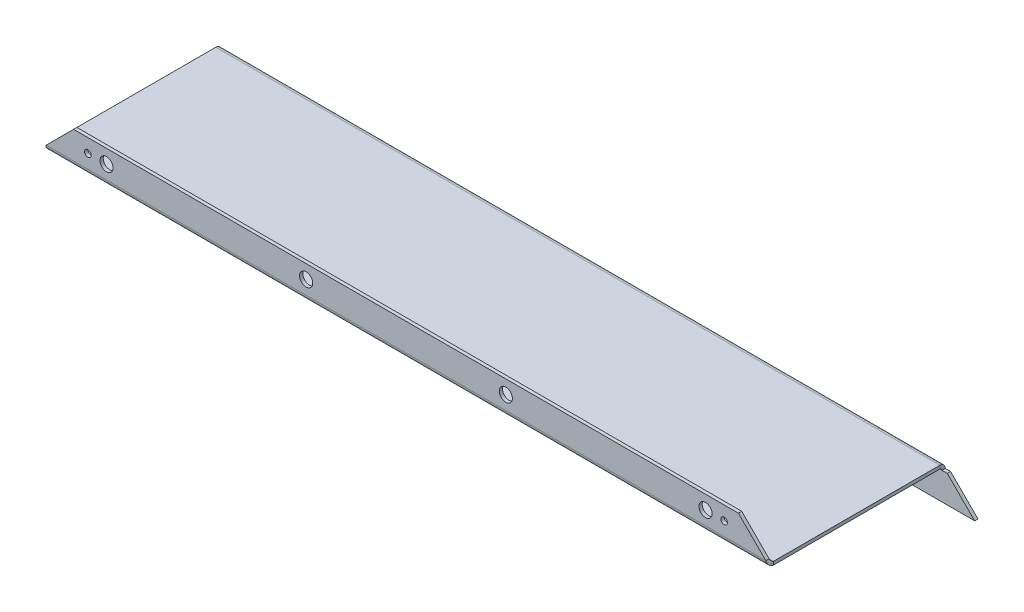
ISO-10303-21;
HEADER;
FILE_DESCRIPTION(('STEP AP214'),'2;1');
FILE_NAME('part.step','',(''),(''),'','','');
FILE_SCHEMA(('AUTOMOTIVE_DESIGN { 1 0 10303 214 1 1 1 1 }'));
ENDSEC;
DATA;
#1=APPLICATION_CONTEXT('core data for automotive mechanical design processes');
#2=APPLICATION_PROTOCOL_DEFINITION('international standard','automotive_design',2000,#1);
#3=PRODUCT_CONTEXT('',#1,'mechanical');
#4=PRODUCT('Part','Part','',(#3));
#5=PRODUCT_RELATED_PRODUCT_CATEGORY('part','',(#4));
#6=PRODUCT_DEFINITION_FORMATION('','',#4);
#7=PRODUCT_DEFINITION_CONTEXT('part definition',#1,'design');
#8=PRODUCT_DEFINITION('design','',#6,#7);
#9=PRODUCT_DEFINITION_SHAPE('','',#8);
#10=(LENGTH_UNIT() NAMED_UNIT(*) SI_UNIT(.MILLI.,.METRE.));
#11=(NAMED_UNIT(*) PLANE_ANGLE_UNIT() SI_UNIT($,.RADIAN.));
#12=(NAMED_UNIT(*) SI_UNIT($,.STERADIAN.) SOLID_ANGLE_UNIT());
#13=UNCERTAINTY_MEASURE_WITH_UNIT(LENGTH_MEASURE(1.E-05),#10,'distance_accuracy_value','');
#14=(GEOMETRIC_REPRESENTATION_CONTEXT(3) GLOBAL_UNCERTAINTY_ASSIGNED_CONTEXT((#13)) GLOBAL_UNIT_ASSIGNED_CONTEXT((#10,
#11,#12)) REPRESENTATION_CONTEXT('',''));
#15=CARTESIAN_POINT('',(0.,0.,0.));
#16=DIRECTION('',(0.,0.,1.));
#17=DIRECTION('',(1.,0.,0.));
#18=AXIS2_PLACEMENT_3D('',#15,#16,#17);
#19=CARTESIAN_POINT('',(165.,-710.5,-79.3));
#20=DIRECTION('',(1.,0.,0.));
#21=DIRECTION('',(0.,0.,-1.));
#22=AXIS2_PLACEMENT_3D('',#19,#20,#21);
#23=PLANE('',#22);
#24=DIRECTION('',(0.,0.,-1.));
#25=VECTOR('',#24,1.);
#26=CARTESIAN_POINT('',(165.,-710.5,-79.3));
#27=LINE('',#26,#25);
#28=CARTESIAN_POINT('',(165.,-710.5,-0.999999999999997));
#29=VERTEX_POINT('',#28);
#30=CARTESIAN_POINT('',(165.,-710.5,-76.8000000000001));
#31=VERTEX_POINT('',#30);
#32=EDGE_CURVE('E256',#29,#31,#27,.T.);
#33=ORIENTED_EDGE('',*,*,#32,.T.);
#34=DIRECTION('',(0.,1.,0.));
#35=VECTOR('',#34,1.);
#36=CARTESIAN_POINT('',(165.,-710.5,-76.8000000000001));
#37=LINE('',#36,#35);
#38=CARTESIAN_POINT('',(165.,-709.,-76.8000000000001));
#39=VERTEX_POINT('',#38);
#40=EDGE_CURVE('E231',#31,#39,#37,.T.);
#41=ORIENTED_EDGE('',*,*,#40,.T.);
#42=DIRECTION('',(0.,0.,1.));
#43=VECTOR('',#42,1.);
#44=CARTESIAN_POINT('',(165.,-709.,1.98944125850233E-12));
#45=LINE('',#44,#43);
#46=CARTESIAN_POINT('',(165.,-709.,-1.));
#47=VERTEX_POINT('',#46);
#48=EDGE_CURVE('E260',#47,#39,#45,.F.);
#49=ORIENTED_EDGE('',*,*,#48,.F.);
#50=DIRECTION('',(0.,-1.,0.));
#51=VECTOR('',#50,1.);
#52=CARTESIAN_POINT('',(165.,-710.5,-1.));
#53=LINE('',#52,#51);
#54=EDGE_CURVE('E251',#47,#29,#53,.T.);
#55=ORIENTED_EDGE('',*,*,#54,.T.);
#56=EDGE_LOOP('',(#33,#41,#49,#55));
#57=FACE_BOUND('',#56,.T.);
#58=ADVANCED_FACE('F78',(#57),#23,.T.);
#59=CARTESIAN_POINT('',(0.,-710.5,1.99467848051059E-12));
#60=DIRECTION('',(0.,-1.,0.));
#61=DIRECTION('',(0.,0.,-1.));
#62=AXIS2_PLACEMENT_3D('',#59,#60,#61);
#63=PLANE('',#62);
#64=DIRECTION('',(0.,0.,1.));
#65=VECTOR('',#64,1.);
#66=CARTESIAN_POINT('',(-165.000000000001,-710.5,0.));
#67=LINE('',#66,#65);
#68=CARTESIAN_POINT('',(-165.000000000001,-710.5,-76.8000000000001));
#69=VERTEX_POINT('',#68);
#70=CARTESIAN_POINT('',(-165.000000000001,-710.5,-0.999999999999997));
#71=VERTEX_POINT('',#70);
#72=EDGE_CURVE('E253',#69,#71,#67,.T.);
#73=ORIENTED_EDGE('',*,*,#72,.F.);
#74=DIRECTION('',(1.,0.,0.));
#75=VECTOR('',#74,1.);
#76=CARTESIAN_POINT('',(165.,-710.5,-76.8000000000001));
#77=LINE('',#76,#75);
#78=EDGE_CURVE('E102',#31,#69,#77,.F.);
#79=ORIENTED_EDGE('',*,*,#78,.F.);
#80=ORIENTED_EDGE('',*,*,#32,.F.);
#81=DIRECTION('',(-1.,0.,0.));
#82=VECTOR('',#81,1.);
#83=CARTESIAN_POINT('',(0.,-710.5,-0.999999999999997));
#84=LINE('',#83,#82);
#85=EDGE_CURVE('E263',#29,#71,#84,.T.);
#86=ORIENTED_EDGE('',*,*,#85,.T.);
#87=EDGE_LOOP('',(#73,#79,#80,#86));
#88=FACE_BOUND('',#87,.T.);
#89=ADVANCED_FACE('F368',(#88),#63,.T.);
#90=CARTESIAN_POINT('',(0.,-709.,1.98944125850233E-12));
#91=DIRECTION('',(0.,-1.,0.));
#92=DIRECTION('',(0.,0.,-1.));
#93=AXIS2_PLACEMENT_3D('',#90,#91,#92);
#94=PLANE('',#93);
#95=DIRECTION('',(1.,0.,0.));
#96=VECTOR('',#95,1.);
#97=CARTESIAN_POINT('',(165.,-709.,-76.8000000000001));
#98=LINE('',#97,#96);
#99=CARTESIAN_POINT('',(-165.000000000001,-709.,-76.8000000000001));
#100=VERTEX_POINT('',#99);
#101=EDGE_CURVE('E226',#39,#100,#98,.F.);
#102=ORIENTED_EDGE('',*,*,#101,.T.);
#103=DIRECTION('',(0.,0.,-1.));
#104=VECTOR('',#103,1.);
#105=CARTESIAN_POINT('',(-165.000000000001,-709.,1.98944125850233E-12));
#106=LINE('',#105,#104);
#107=CARTESIAN_POINT('',(-165.000000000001,-709.,-1.));
#108=VERTEX_POINT('',#107);
#109=EDGE_CURVE('E258',#100,#108,#106,.F.);
#110=ORIENTED_EDGE('',*,*,#109,.T.);
#111=DIRECTION('',(1.,0.,0.));
#112=VECTOR('',#111,1.);
#113=CARTESIAN_POINT('',(165.,-709.,-1.));
#114=LINE('',#113,#112);
#115=EDGE_CURVE('E269',#47,#108,#114,.F.);
#116=ORIENTED_EDGE('',*,*,#115,.F.);
#117=ORIENTED_EDGE('',*,*,#48,.T.);
#118=EDGE_LOOP('',(#102,#110,#116,#117));
#119=FACE_BOUND('',#118,.T.);
#120=ADVANCED_FACE('F354',(#119),#94,.F.);
#121=CARTESIAN_POINT('',(-166.5,-710.5,1.5));
#122=DIRECTION('',(0.707106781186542,-0.707106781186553,0.));
#123=DIRECTION('',(0.707106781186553,0.707106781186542,0.));
#124=AXIS2_PLACEMENT_3D('',#121,#122,#123);
#125=PLANE('',#124);
#126=DIRECTION('',(0.,0.,1.));
#127=VECTOR('',#126,1.);
#128=CARTESIAN_POINT('',(-164.,-708.,0.));
#129=LINE('',#128,#127);
#130=CARTESIAN_POINT('',(-164.,-708.,0.));
#131=VERTEX_POINT('',#130);
#132=CARTESIAN_POINT('',(-164.,-708.,1.5));
#133=VERTEX_POINT('',#132);
#134=EDGE_CURVE('E287',#131,#133,#129,.T.);
#135=ORIENTED_EDGE('',*,*,#134,.T.);
#136=DIRECTION('',(-0.707106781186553,-0.707106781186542,0.));
#137=VECTOR('',#136,1.);
#138=CARTESIAN_POINT('',(-166.5,-710.5,1.5));
#139=LINE('',#138,#137);
#140=CARTESIAN_POINT('',(-151.5,-695.5,1.5));
#141=VERTEX_POINT('',#140);
#142=EDGE_CURVE('E454',#141,#133,#139,.T.);
#143=ORIENTED_EDGE('',*,*,#142,.F.);
#144=DIRECTION('',(0.,0.,-1.));
#145=VECTOR('',#144,1.);
#146=CARTESIAN_POINT('',(-151.5,-695.5,1.5));
#147=LINE('',#146,#145);
#148=CARTESIAN_POINT('',(-151.5,-695.5,0.));
#149=VERTEX_POINT('',#148);
#150=EDGE_CURVE('E286',#141,#149,#147,.T.);
#151=ORIENTED_EDGE('',*,*,#150,.T.);
#152=DIRECTION('',(-0.707106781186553,-0.707106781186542,0.));
#153=VECTOR('',#152,1.);
#154=CARTESIAN_POINT('',(-166.5,-710.5,0.));
#155=LINE('',#154,#153);
#156=EDGE_CURVE('E472',#149,#131,#155,.T.);
#157=ORIENTED_EDGE('',*,*,#156,.T.);
#158=EDGE_LOOP('',(#135,#143,#151,#157));
#159=FACE_BOUND('',#158,.T.);
#160=ADVANCED_FACE('F350',(#159),#125,.F.);
#161=CARTESIAN_POINT('',(0.,0.,1.5));
#162=DIRECTION('',(0.,0.,-1.));
#163=DIRECTION('',(-1.,0.,0.));
#164=AXIS2_PLACEMENT_3D('',#161,#162,#163);
#165=PLANE('',#164);
#166=CARTESIAN_POINT('',(136.5,-701.75,1.5));
#167=DIRECTION('',(0.,0.,-1.));
#168=DIRECTION('',(-1.,0.,0.));
#169=AXIS2_PLACEMENT_3D('',#166,#167,#168);
#170=CIRCLE('',#169,2.99999999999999);
#171=CARTESIAN_POINT('',(133.5,-701.75,1.5));
#172=VERTEX_POINT('',#171);
#173=EDGE_CURVE('E402',#172,#172,#170,.T.);
#174=ORIENTED_EDGE('',*,*,#173,.T.);
#175=EDGE_LOOP('',(#174));
#176=FACE_BOUND('',#175,.T.);
#177=CARTESIAN_POINT('',(45.5000000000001,-701.75,1.5));
#178=DIRECTION('',(0.,0.,-1.));
#179=DIRECTION('',(-1.,0.,0.));
#180=AXIS2_PLACEMENT_3D('',#177,#178,#179);
#181=CIRCLE('',#180,3.00000000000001);
#182=CARTESIAN_POINT('',(42.5000000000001,-701.75,1.5));
#183=VERTEX_POINT('',#182);
#184=EDGE_CURVE('E412',#183,#183,#181,.T.);
#185=ORIENTED_EDGE('',*,*,#184,.T.);
#186=EDGE_LOOP('',(#185));
#187=FACE_BOUND('',#186,.T.);
#188=CARTESIAN_POINT('',(-45.5,-701.75,1.5));
#189=DIRECTION('',(0.,0.,-1.));
#190=DIRECTION('',(-1.,0.,0.));
#191=AXIS2_PLACEMENT_3D('',#188,#189,#190);
#192=CIRCLE('',#191,3.00000000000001);
#193=CARTESIAN_POINT('',(-48.5,-701.75,1.5));
#194=VERTEX_POINT('',#193);
#195=EDGE_CURVE('E416',#194,#194,#192,.T.);
#196=ORIENTED_EDGE('',*,*,#195,.T.);
#197=EDGE_LOOP('',(#196));
#198=FACE_BOUND('',#197,.T.);
#199=CARTESIAN_POINT('',(-136.5,-701.75,1.5));
#200=DIRECTION('',(0.,0.,-1.));
#201=DIRECTION('',(-1.,0.,0.));
#202=AXIS2_PLACEMENT_3D('',#199,#200,#201);
#203=CIRCLE('',#202,2.99999999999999);
#204=CARTESIAN_POINT('',(-139.5,-701.75,1.5));
#205=VERTEX_POINT('',#204);
#206=EDGE_CURVE('E420',#205,#205,#203,.T.);
#207=ORIENTED_EDGE('',*,*,#206,.T.);
#208=EDGE_LOOP('',(#207));
#209=FACE_BOUND('',#208,.T.);
#210=CARTESIAN_POINT('',(145.,-701.75,1.5));
#211=DIRECTION('',(0.,0.,1.));
#212=DIRECTION('',(1.,0.,0.));
#213=AXIS2_PLACEMENT_3D('',#210,#211,#212);
#214=CIRCLE('',#213,1.49999999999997);
#215=CARTESIAN_POINT('',(146.5,-701.75,1.5));
#216=VERTEX_POINT('',#215);
#217=EDGE_CURVE('E405',#216,#216,#214,.T.);
#218=ORIENTED_EDGE('',*,*,#217,.F.);
#219=EDGE_LOOP('',(#218));
#220=FACE_BOUND('',#219,.T.);
#221=CARTESIAN_POINT('',(-145.000000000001,-701.750000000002,1.5));
#222=DIRECTION('',(0.,0.,1.));
#223=DIRECTION('',(1.,0.,0.));
#224=AXIS2_PLACEMENT_3D('',#221,#222,#223);
#225=CIRCLE('',#224,1.49999999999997);
#226=CARTESIAN_POINT('',(-143.500000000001,-701.750000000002,1.5));
#227=VERTEX_POINT('',#226);
#228=EDGE_CURVE('E398',#227,#227,#225,.T.);
#229=ORIENTED_EDGE('',*,*,#228,.F.);
#230=EDGE_LOOP('',(#229));
#231=FACE_BOUND('',#230,.T.);
#232=DIRECTION('',(-1.,0.,0.));
#233=VECTOR('',#232,1.);
#234=CARTESIAN_POINT('',(-165.000000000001,-708.,1.5));
#235=LINE('',#234,#233);
#236=CARTESIAN_POINT('',(164.,-708.,1.5));
#237=VERTEX_POINT('',#236);
#238=EDGE_CURVE('E278',#133,#237,#235,.F.);
#239=ORIENTED_EDGE('',*,*,#238,.T.);
#240=DIRECTION('',(-0.707106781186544,0.707106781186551,0.));
#241=VECTOR('',#240,1.);
#242=CARTESIAN_POINT('',(166.5,-710.5,1.5));
#243=LINE('',#242,#241);
#244=CARTESIAN_POINT('',(151.5,-695.5,1.5));
#245=VERTEX_POINT('',#244);
#246=EDGE_CURVE('E432',#237,#245,#243,.T.);
#247=ORIENTED_EDGE('',*,*,#246,.T.);
#248=DIRECTION('',(-1.,0.,0.));
#249=VECTOR('',#248,1.);
#250=CARTESIAN_POINT('',(151.5,-695.5,1.5));
#251=LINE('',#250,#249);
#252=EDGE_CURVE('E468',#245,#141,#251,.T.);
#253=ORIENTED_EDGE('',*,*,#252,.T.);
#254=ORIENTED_EDGE('',*,*,#142,.T.);
#255=EDGE_LOOP('',(#239,#247,#253,#254));
#256=FACE_BOUND('',#255,.T.);
#257=ADVANCED_FACE('F353',(#176,#187,#198,#209,#220,#231,#256),#165,.F.);
#258=CARTESIAN_POINT('',(0.,0.,0.));
#259=DIRECTION('',(0.,0.,-1.));
#260=DIRECTION('',(-1.,0.,0.));
#261=AXIS2_PLACEMENT_3D('',#258,#259,#260);
#262=PLANE('',#261);
#263=CARTESIAN_POINT('',(136.5,-701.75,0.));
#264=DIRECTION('',(0.,0.,-1.));
#265=DIRECTION('',(-1.,0.,0.));
#266=AXIS2_PLACEMENT_3D('',#263,#264,#265);
#267=CIRCLE('',#266,2.99999999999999);
#268=CARTESIAN_POINT('',(133.5,-701.75,0.));
#269=VERTEX_POINT('',#268);
#270=EDGE_CURVE('E82',#269,#269,#267,.T.);
#271=ORIENTED_EDGE('',*,*,#270,.F.);
#272=EDGE_LOOP('',(#271));
#273=FACE_BOUND('',#272,.T.);
#274=CARTESIAN_POINT('',(45.5000000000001,-701.75,0.));
#275=DIRECTION('',(0.,0.,-1.));
#276=DIRECTION('',(-1.,0.,0.));
#277=AXIS2_PLACEMENT_3D('',#274,#275,#276);
#278=CIRCLE('',#277,3.00000000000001);
#279=CARTESIAN_POINT('',(42.5000000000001,-701.75,0.));
#280=VERTEX_POINT('',#279);
#281=EDGE_CURVE('E415',#280,#280,#278,.T.);
#282=ORIENTED_EDGE('',*,*,#281,.F.);
#283=EDGE_LOOP('',(#282));
#284=FACE_BOUND('',#283,.T.);
#285=CARTESIAN_POINT('',(-45.5,-701.75,0.));
#286=DIRECTION('',(0.,0.,-1.));
#287=DIRECTION('',(-1.,0.,0.));
#288=AXIS2_PLACEMENT_3D('',#285,#286,#287);
#289=CIRCLE('',#288,3.00000000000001);
#290=CARTESIAN_POINT('',(-48.5,-701.75,0.));
#291=VERTEX_POINT('',#290);
#292=EDGE_CURVE('E419',#291,#291,#289,.T.);
#293=ORIENTED_EDGE('',*,*,#292,.F.);
#294=EDGE_LOOP('',(#293));
#295=FACE_BOUND('',#294,.T.);
#296=CARTESIAN_POINT('',(-136.5,-701.75,0.));
#297=DIRECTION('',(0.,0.,-1.));
#298=DIRECTION('',(-1.,0.,0.));
#299=AXIS2_PLACEMENT_3D('',#296,#297,#298);
#300=CIRCLE('',#299,2.99999999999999);
#301=CARTESIAN_POINT('',(-139.5,-701.75,0.));
#302=VERTEX_POINT('',#301);
#303=EDGE_CURVE('E422',#302,#302,#300,.T.);
#304=ORIENTED_EDGE('',*,*,#303,.F.);
#305=EDGE_LOOP('',(#304));
#306=FACE_BOUND('',#305,.T.);
#307=CARTESIAN_POINT('',(145.,-701.75,0.));
#308=DIRECTION('',(0.,0.,1.));
#309=DIRECTION('',(1.,0.,0.));
#310=AXIS2_PLACEMENT_3D('',#307,#308,#309);
#311=CIRCLE('',#310,1.49999999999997);
#312=CARTESIAN_POINT('',(146.5,-701.75,0.));
#313=VERTEX_POINT('',#312);
#314=EDGE_CURVE('E195',#313,#313,#311,.T.);
#315=ORIENTED_EDGE('',*,*,#314,.T.);
#316=EDGE_LOOP('',(#315));
#317=FACE_BOUND('',#316,.T.);
#318=CARTESIAN_POINT('',(-145.000000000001,-701.750000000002,0.));
#319=DIRECTION('',(0.,0.,1.));
#320=DIRECTION('',(1.,0.,0.));
#321=AXIS2_PLACEMENT_3D('',#318,#319,#320);
#322=CIRCLE('',#321,1.49999999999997);
#323=CARTESIAN_POINT('',(-143.500000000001,-701.750000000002,0.));
#324=VERTEX_POINT('',#323);
#325=EDGE_CURVE('E401',#324,#324,#322,.T.);
#326=ORIENTED_EDGE('',*,*,#325,.T.);
#327=EDGE_LOOP('',(#326));
#328=FACE_BOUND('',#327,.T.);
#329=DIRECTION('',(-0.707106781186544,0.707106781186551,0.));
#330=VECTOR('',#329,1.);
#331=CARTESIAN_POINT('',(166.5,-710.5,0.));
#332=LINE('',#331,#330);
#333=CARTESIAN_POINT('',(164.,-708.,0.));
#334=VERTEX_POINT('',#333);
#335=CARTESIAN_POINT('',(151.5,-695.5,0.));
#336=VERTEX_POINT('',#335);
#337=EDGE_CURVE('E450',#334,#336,#332,.T.);
#338=ORIENTED_EDGE('',*,*,#337,.F.);
#339=DIRECTION('',(-1.,0.,0.));
#340=VECTOR('',#339,1.);
#341=CARTESIAN_POINT('',(-165.000000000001,-708.,0.));
#342=LINE('',#341,#340);
#343=EDGE_CURVE('E274',#131,#334,#342,.F.);
#344=ORIENTED_EDGE('',*,*,#343,.F.);
#345=ORIENTED_EDGE('',*,*,#156,.F.);
#346=DIRECTION('',(-1.,0.,0.));
#347=VECTOR('',#346,1.);
#348=CARTESIAN_POINT('',(151.5,-695.5,0.));
#349=LINE('',#348,#347);
#350=EDGE_CURVE('E87',#336,#149,#349,.T.);
#351=ORIENTED_EDGE('',*,*,#350,.F.);
#352=EDGE_LOOP('',(#338,#344,#345,#351));
#353=FACE_BOUND('',#352,.T.);
#354=ADVANCED_FACE('F357',(#273,#284,#295,#306,#317,#328,#353),#262,.T.);
#355=CARTESIAN_POINT('',(166.5,-710.5,1.5));
#356=DIRECTION('',(-0.707106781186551,-0.707106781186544,0.));
#357=DIRECTION('',(0.707106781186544,-0.707106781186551,0.));
#358=AXIS2_PLACEMENT_3D('',#355,#356,#357);
#359=PLANE('',#358);
#360=ORIENTED_EDGE('',*,*,#246,.F.);
#361=DIRECTION('',(0.,0.,1.));
#362=VECTOR('',#361,1.);
#363=CARTESIAN_POINT('',(164.,-708.,0.));
#364=LINE('',#363,#362);
#365=EDGE_CURVE('E283',#334,#237,#364,.T.);
#366=ORIENTED_EDGE('',*,*,#365,.F.);
#367=ORIENTED_EDGE('',*,*,#337,.T.);
#368=DIRECTION('',(0.,0.,-1.));
#369=VECTOR('',#368,1.);
#370=CARTESIAN_POINT('',(151.5,-695.5,1.5));
#371=LINE('',#370,#369);
#372=EDGE_CURVE('E13',#245,#336,#371,.T.);
#373=ORIENTED_EDGE('',*,*,#372,.F.);
#374=EDGE_LOOP('',(#360,#366,#367,#373));
#375=FACE_BOUND('',#374,.T.);
#376=ADVANCED_FACE('F80',(#375),#359,.F.);
#377=CARTESIAN_POINT('',(151.5,-695.5,1.5));
#378=DIRECTION('',(0.,-1.,0.));
#379=DIRECTION('',(1.,0.,0.));
#380=AXIS2_PLACEMENT_3D('',#377,#378,#379);
#381=PLANE('',#380);
#382=ORIENTED_EDGE('',*,*,#350,.T.);
#383=ORIENTED_EDGE('',*,*,#150,.F.);
#384=ORIENTED_EDGE('',*,*,#252,.F.);
#385=ORIENTED_EDGE('',*,*,#372,.T.);
#386=EDGE_LOOP('',(#382,#383,#384,#385));
#387=FACE_BOUND('',#386,.T.);
#388=ADVANCED_FACE('F340',(#387),#381,.F.);
#389=CARTESIAN_POINT('',(164.,-708.,1.515));
#390=CARTESIAN_POINT('',(164.08334747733,-708.329268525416,1.515));
#391=CARTESIAN_POINT('',(164.166666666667,-708.658295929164,1.44954128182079));
#392=CARTESIAN_POINT('',(164.333333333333,-709.266601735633,1.19757276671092));
#393=CARTESIAN_POINT('',(164.416666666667,-709.545585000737,1.0111621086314));
#394=CARTESIAN_POINT('',(164.583333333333,-710.011162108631,0.54558500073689));
#395=CARTESIAN_POINT('',(164.666666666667,-710.197572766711,0.266601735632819));
#396=CARTESIAN_POINT('',(164.833333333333,-710.449541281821,-0.341704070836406));
#397=CARTESIAN_POINT('',(164.91665252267,-710.515,-0.670731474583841));
#398=CARTESIAN_POINT('',(165.,-710.515,-1.));
#399=CARTESIAN_POINT('',(164.,-708.,1.5));
#400=CARTESIAN_POINT('',(164.083347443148,-708.32730464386,1.5));
#401=CARTESIAN_POINT('',(164.166666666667,-708.654369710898,1.43493169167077));
#402=CARTESIAN_POINT('',(164.333333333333,-709.259047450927,1.18446597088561));
#403=CARTESIAN_POINT('',(164.416666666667,-709.536366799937,0.999167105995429));
#404=CARTESIAN_POINT('',(164.583333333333,-709.999167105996,0.536366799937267));
#405=CARTESIAN_POINT('',(164.666666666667,-710.184465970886,0.259047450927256));
#406=CARTESIAN_POINT('',(164.833333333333,-710.434931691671,-0.345630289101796));
#407=CARTESIAN_POINT('',(164.916652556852,-710.5,-0.672695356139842));
#408=CARTESIAN_POINT('',(165.,-710.5,-1.));
#409=CARTESIAN_POINT('',(164.,-708.,0.));
#410=CARTESIAN_POINT('',(164.083344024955,-708.13091648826,0.));
#411=CARTESIAN_POINT('',(164.166666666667,-708.261747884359,-0.0260273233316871));
#412=CARTESIAN_POINT('',(164.333333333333,-708.503618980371,-0.126213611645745));
#413=CARTESIAN_POINT('',(164.416666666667,-708.614546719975,-0.200333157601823));
#414=CARTESIAN_POINT('',(164.583333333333,-708.799666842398,-0.385453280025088));
#415=CARTESIAN_POINT('',(164.666666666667,-708.873786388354,-0.496381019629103));
#416=CARTESIAN_POINT('',(164.833333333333,-708.973972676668,-0.738252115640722));
#417=CARTESIAN_POINT('',(164.916655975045,-709.,-0.869083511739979));
#418=CARTESIAN_POINT('',(165.,-709.,-1.));
#419=CARTESIAN_POINT('',(164.,-708.,-0.0151500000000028));
#420=CARTESIAN_POINT('',(164.083343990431,-708.128932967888,-0.0151500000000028));
#421=CARTESIAN_POINT('',(164.166666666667,-708.257782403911,-0.0407830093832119));
#422=CARTESIAN_POINT('',(164.333333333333,-708.495989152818,-0.139451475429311));
#423=CARTESIAN_POINT('',(164.416666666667,-708.605236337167,-0.212448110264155));
#424=CARTESIAN_POINT('',(164.583333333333,-708.787551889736,-0.394763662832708));
#425=CARTESIAN_POINT('',(164.666666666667,-708.860548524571,-0.504010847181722));
#426=CARTESIAN_POINT('',(164.833333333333,-708.959216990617,-0.742217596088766));
#427=CARTESIAN_POINT('',(164.916656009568,-708.98485,-0.87106703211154));
#428=CARTESIAN_POINT('',(165.,-708.98485,-1.));
#429=B_SPLINE_SURFACE_WITH_KNOTS('',1,3,((#389,#390,#391,#392,#393,#394,#395,#396,#397,#398),
(#399,#400,#401,#402,#403,#404,#405,#406,#407,#408),(#409,#410,#411,#412,#413,#414,#415,#416,
#417,#418),(#419,#420,#421,#422,#423,#424,#425,#426,#427,#428)),.UNSPECIFIED.,.F.,.F.,.F.,(2,1,
1,2),(4,2,2,2,4),(-0.01,0.,1.,1.0101),(0.,0.25,0.5,0.75,1.),.UNSPECIFIED.);
#430=CARTESIAN_POINT('',(164.,-708.,0.));
#431=CARTESIAN_POINT('',(164.022895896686,-708.035962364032,7.59315880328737E-06));
#432=CARTESIAN_POINT('',(164.045789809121,-708.071923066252,-0.00193976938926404));
#433=CARTESIAN_POINT('',(164.091576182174,-708.143426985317,-0.00968794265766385));
#434=CARTESIAN_POINT('',(164.114468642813,-708.178970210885,-0.0154886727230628));
#435=CARTESIAN_POINT('',(164.160221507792,-708.249174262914,-0.0308756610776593));
#436=CARTESIAN_POINT('',(164.183081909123,-708.283836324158,-0.0404562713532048));
#437=CARTESIAN_POINT('',(164.228795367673,-708.351918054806,-0.0632799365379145));
#438=CARTESIAN_POINT('',(164.251648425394,-708.385337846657,-0.07652262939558));
#439=CARTESIAN_POINT('',(164.317000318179,-708.478590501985,-0.119435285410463));
#440=CARTESIAN_POINT('',(164.359526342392,-708.536474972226,-0.15344935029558));
#441=CARTESIAN_POINT('',(164.444535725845,-708.644254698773,-0.232277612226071));
#442=CARTESIAN_POINT('',(164.487019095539,-708.694154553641,-0.27708555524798));
#443=CARTESIAN_POINT('',(164.571984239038,-708.784051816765,-0.375730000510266));
#444=CARTESIAN_POINT('',(164.614466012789,-708.824049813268,-0.429565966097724));
#445=CARTESIAN_POINT('',(164.699449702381,-708.892551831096,-0.544140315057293));
#446=CARTESIAN_POINT('',(164.741951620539,-708.921052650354,-0.604880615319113));
#447=CARTESIAN_POINT('',(164.82038478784,-708.961973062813,-0.721086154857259));
#448=CARTESIAN_POINT('',(164.856319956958,-708.976193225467,-0.775923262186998));
#449=CARTESIAN_POINT('',(164.928166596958,-708.995225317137,-0.887165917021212));
#450=CARTESIAN_POINT('',(164.964078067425,-709.00004360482,-0.943570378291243));
#451=CARTESIAN_POINT('',(165.,-709.,-1.));
#452=B_SPLINE_CURVE_WITH_KNOTS('',3,(#430,#431,#432,#433,#434,#435,#436,#437,#438,#439,#440,
#441,#442,#443,#444,#445,#446,#447,#448,#449,#450,#451),.UNSPECIFIED.,.F.,.F.,(4,2,2,2,2,2,2,2,
2,2,4),(0.,0.127848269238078,0.255693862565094,0.383349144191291,0.510991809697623,
0.748186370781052,0.985243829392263,1.22228720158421,1.45939654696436,1.65999150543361,
1.86045075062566),.UNSPECIFIED.);
#453=EDGE_CURVE('E277',#334,#47,#452,.T.);
#454=CARTESIAN_POINT('',(164.,-708.,1.5));
#455=CARTESIAN_POINT('',(164.015774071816,-708.061942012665,1.50000078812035));
#456=CARTESIAN_POINT('',(164.031543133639,-708.123864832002,1.49769714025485));
#457=CARTESIAN_POINT('',(164.063078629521,-708.247360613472,1.48850298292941));
#458=CARTESIAN_POINT('',(164.078845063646,-708.308933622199,1.48161309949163));
#459=CARTESIAN_POINT('',(164.126151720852,-708.492662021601,1.45409978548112));
#460=CARTESIAN_POINT('',(164.157705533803,-708.613851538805,1.42663267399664));
#461=CARTESIAN_POINT('',(164.226204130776,-708.871042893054,1.34783427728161));
#462=CARTESIAN_POINT('',(164.263150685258,-709.00604666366,1.2932323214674));
#463=CARTESIAN_POINT('',(164.337039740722,-709.264561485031,1.16146616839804));
#464=CARTESIAN_POINT('',(164.373982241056,-709.388071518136,1.08429997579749));
#465=CARTESIAN_POINT('',(164.447870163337,-709.619853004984,0.909744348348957));
#466=CARTESIAN_POINT('',(164.484815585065,-709.728125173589,0.812355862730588));
#467=CARTESIAN_POINT('',(164.558709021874,-709.926176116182,0.600279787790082));
#468=CARTESIAN_POINT('',(164.595657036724,-710.015952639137,0.485590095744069));
#469=CARTESIAN_POINT('',(164.669558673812,-710.174295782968,0.242379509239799));
#470=CARTESIAN_POINT('',(164.706512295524,-710.24285778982,0.11385561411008));
#471=CARTESIAN_POINT('',(164.780412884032,-710.35664808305,-0.153104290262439));
#472=CARTESIAN_POINT('',(164.817359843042,-710.401889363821,-0.291534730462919));
#473=CARTESIAN_POINT('',(164.878590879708,-710.456458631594,-0.525718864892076));
#474=CARTESIAN_POINT('',(164.902889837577,-710.472775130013,-0.619899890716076));
#475=CARTESIAN_POINT('',(164.951454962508,-710.494545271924,-0.809374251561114));
#476=CARTESIAN_POINT('',(164.975721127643,-710.500014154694,-0.904665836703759));
#477=CARTESIAN_POINT('',(165.,-710.5,-1.));
#478=B_SPLINE_CURVE_WITH_KNOTS('',3,(#454,#455,#456,#457,#458,#459,#460,#461,#462,#463,#464,
#465,#466,#467,#468,#469,#470,#471,#472,#473,#474,#475,#476,#477),.UNSPECIFIED.,.F.,.F.,(4,2,2,
2,2,2,2,2,2,2,2,4),(0.,0.19167598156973,0.383325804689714,0.766549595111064,1.21512109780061,
1.66373227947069,2.11232240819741,2.56096710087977,3.00970930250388,3.4582011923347,
3.75350969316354,4.04840303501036),.UNSPECIFIED.);
#479=EDGE_CURVE('E281',#237,#29,#478,.T.);
#480=ORIENTED_EDGE('',*,*,#54,.F.);
#481=ORIENTED_EDGE('',*,*,#453,.F.);
#482=ORIENTED_EDGE('',*,*,#365,.T.);
#483=ORIENTED_EDGE('',*,*,#479,.T.);
#484=EDGE_LOOP('',(#480,#481,#482,#483));
#485=FACE_BOUND('',#484,.T.);
#486=ADVANCED_FACE('F304',(#485),#429,.F.);
#487=CARTESIAN_POINT('',(-165.000000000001,-710.515,-0.999999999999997));
#488=CARTESIAN_POINT('',(-164.916652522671,-710.515,-0.670731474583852));
#489=CARTESIAN_POINT('',(-164.833333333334,-710.449541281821,-0.341704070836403));
#490=CARTESIAN_POINT('',(-164.666666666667,-710.197572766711,0.266601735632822));
#491=CARTESIAN_POINT('',(-164.583333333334,-710.011162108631,0.545585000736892));
#492=CARTESIAN_POINT('',(-164.416666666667,-709.545585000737,1.0111621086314));
#493=CARTESIAN_POINT('',(-164.333333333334,-709.266601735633,1.19757276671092));
#494=CARTESIAN_POINT('',(-164.166666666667,-708.658295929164,1.44954128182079));
#495=CARTESIAN_POINT('',(-164.08334747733,-708.329268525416,1.515));
#496=CARTESIAN_POINT('',(-164.,-708.,1.515));
#497=CARTESIAN_POINT('',(-165.000000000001,-710.5,-0.999999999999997));
#498=CARTESIAN_POINT('',(-164.916652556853,-710.5,-0.672695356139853));
#499=CARTESIAN_POINT('',(-164.833333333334,-710.434931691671,-0.345630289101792));
#500=CARTESIAN_POINT('',(-164.666666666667,-710.184465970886,0.259047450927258));
#501=CARTESIAN_POINT('',(-164.583333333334,-709.999167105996,0.536366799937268));
#502=CARTESIAN_POINT('',(-164.416666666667,-709.536366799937,0.99916710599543));
#503=CARTESIAN_POINT('',(-164.333333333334,-709.259047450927,1.18446597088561));
#504=CARTESIAN_POINT('',(-164.166666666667,-708.654369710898,1.43493169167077));
#505=CARTESIAN_POINT('',(-164.083347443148,-708.32730464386,1.5));
#506=CARTESIAN_POINT('',(-164.,-708.,1.5));
#507=CARTESIAN_POINT('',(-165.000000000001,-709.,-1.));
#508=CARTESIAN_POINT('',(-164.916655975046,-709.,-0.869083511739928));
#509=CARTESIAN_POINT('',(-164.833333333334,-708.973972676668,-0.738252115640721));
#510=CARTESIAN_POINT('',(-164.666666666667,-708.873786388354,-0.496381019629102));
#511=CARTESIAN_POINT('',(-164.583333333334,-708.799666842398,-0.385453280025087));
#512=CARTESIAN_POINT('',(-164.416666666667,-708.614546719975,-0.200333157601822));
#513=CARTESIAN_POINT('',(-164.333333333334,-708.503618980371,-0.126213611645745));
#514=CARTESIAN_POINT('',(-164.166666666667,-708.261747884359,-0.0260273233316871));
#515=CARTESIAN_POINT('',(-164.083344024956,-708.13091648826,0.));
#516=CARTESIAN_POINT('',(-164.,-708.,0.));
#517=CARTESIAN_POINT('',(-165.000000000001,-708.98485,-1.));
#518=CARTESIAN_POINT('',(-164.916656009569,-708.98485,-0.871067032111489));
#519=CARTESIAN_POINT('',(-164.833333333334,-708.959216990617,-0.742217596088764));
#520=CARTESIAN_POINT('',(-164.666666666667,-708.860548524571,-0.504010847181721));
#521=CARTESIAN_POINT('',(-164.583333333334,-708.787551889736,-0.394763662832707));
#522=CARTESIAN_POINT('',(-164.416666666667,-708.605236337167,-0.212448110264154));
#523=CARTESIAN_POINT('',(-164.333333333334,-708.495989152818,-0.139451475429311));
#524=CARTESIAN_POINT('',(-164.166666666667,-708.257782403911,-0.0407830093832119));
#525=CARTESIAN_POINT('',(-164.083343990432,-708.128932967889,-0.0151500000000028));
#526=CARTESIAN_POINT('',(-164.,-708.,-0.0151500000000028));
#527=B_SPLINE_SURFACE_WITH_KNOTS('',1,3,((#487,#488,#489,#490,#491,#492,#493,#494,#495,#496),
(#497,#498,#499,#500,#501,#502,#503,#504,#505,#506),(#507,#508,#509,#510,#511,#512,#513,#514,
#515,#516),(#517,#518,#519,#520,#521,#522,#523,#524,#525,#526)),.UNSPECIFIED.,.F.,.F.,.F.,(2,1,
1,2),(4,2,2,2,4),(-0.01,0.,1.,1.0101),(0.,0.25,0.5,0.75,1.),.UNSPECIFIED.);
#528=CARTESIAN_POINT('',(-165.000000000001,-709.,-1.));
#529=CARTESIAN_POINT('',(-164.977104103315,-709.000007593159,-0.964037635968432));
#530=CARTESIAN_POINT('',(-164.95421019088,-708.998060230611,-0.928076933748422));
#531=CARTESIAN_POINT('',(-164.908423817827,-708.990312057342,-0.856573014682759));
#532=CARTESIAN_POINT('',(-164.885531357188,-708.984511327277,-0.821029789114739));
#533=CARTESIAN_POINT('',(-164.839778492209,-708.969124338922,-0.750825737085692));
#534=CARTESIAN_POINT('',(-164.816918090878,-708.959543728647,-0.716163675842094));
#535=CARTESIAN_POINT('',(-164.771204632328,-708.936720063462,-0.648081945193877));
#536=CARTESIAN_POINT('',(-164.748351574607,-708.923477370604,-0.614662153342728));
#537=CARTESIAN_POINT('',(-164.682999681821,-708.880564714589,-0.521409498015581));
#538=CARTESIAN_POINT('',(-164.640473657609,-708.846550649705,-0.463525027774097));
#539=CARTESIAN_POINT('',(-164.555464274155,-708.767722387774,-0.355745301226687));
#540=CARTESIAN_POINT('',(-164.512980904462,-708.722914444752,-0.305845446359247));
#541=CARTESIAN_POINT('',(-164.428015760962,-708.62426999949,-0.215948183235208));
#542=CARTESIAN_POINT('',(-164.385533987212,-708.570434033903,-0.175950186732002));
#543=CARTESIAN_POINT('',(-164.300550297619,-708.455859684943,-0.107448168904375));
#544=CARTESIAN_POINT('',(-164.258048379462,-708.395119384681,-0.0789473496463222));
#545=CARTESIAN_POINT('',(-164.17961521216,-708.278913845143,-0.0380269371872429));
#546=CARTESIAN_POINT('',(-164.143680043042,-708.224076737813,-0.0238067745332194));
#547=CARTESIAN_POINT('',(-164.071833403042,-708.112834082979,-0.00477468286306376));
#548=CARTESIAN_POINT('',(-164.035921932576,-708.056429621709,4.36048201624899E-05));
#549=CARTESIAN_POINT('',(-164.,-708.,0.));
#550=B_SPLINE_CURVE_WITH_KNOTS('',3,(#528,#529,#530,#531,#532,#533,#534,#535,#536,#537,#538,
#539,#540,#541,#542,#543,#544,#545,#546,#547,#548,#549),.UNSPECIFIED.,.F.,.F.,(4,2,2,2,2,2,2,2,
2,2,4),(0.,0.127848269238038,0.25569386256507,0.383349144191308,0.510991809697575,
0.748186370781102,0.985243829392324,1.22228720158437,1.45939654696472,1.65999150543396,
1.86045075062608),.UNSPECIFIED.);
#551=EDGE_CURVE('E255',#108,#131,#550,.T.);
#552=DIRECTION('',(0.,-1.,0.));
#553=VECTOR('',#552,1.);
#554=CARTESIAN_POINT('',(-165.000000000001,-709.,-1.));
#555=LINE('',#554,#553);
#556=EDGE_CURVE('E266',#108,#71,#555,.T.);
#557=CARTESIAN_POINT('',(-165.000000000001,-710.5,-0.999999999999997));
#558=CARTESIAN_POINT('',(-164.984225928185,-710.50000078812,-0.938057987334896));
#559=CARTESIAN_POINT('',(-164.968456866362,-710.497697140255,-0.876135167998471));
#560=CARTESIAN_POINT('',(-164.936921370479,-710.48850298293,-0.752639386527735));
#561=CARTESIAN_POINT('',(-164.921154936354,-710.481613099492,-0.691066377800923));
#562=CARTESIAN_POINT('',(-164.873848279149,-710.454099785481,-0.507337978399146));
#563=CARTESIAN_POINT('',(-164.842294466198,-710.426632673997,-0.386148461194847));
#564=CARTESIAN_POINT('',(-164.773795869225,-710.347834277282,-0.128957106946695));
#565=CARTESIAN_POINT('',(-164.736849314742,-710.293232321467,0.0060466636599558));
#566=CARTESIAN_POINT('',(-164.662960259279,-710.161466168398,0.264561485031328));
#567=CARTESIAN_POINT('',(-164.626017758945,-710.084299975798,0.388071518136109));
#568=CARTESIAN_POINT('',(-164.552129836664,-709.909744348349,0.619853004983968));
#569=CARTESIAN_POINT('',(-164.515184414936,-709.812355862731,0.728125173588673));
#570=CARTESIAN_POINT('',(-164.441290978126,-709.60027978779,0.926176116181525));
#571=CARTESIAN_POINT('',(-164.404342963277,-709.485590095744,1.0159526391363));
#572=CARTESIAN_POINT('',(-164.330441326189,-709.24237950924,1.17429578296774));
#573=CARTESIAN_POINT('',(-164.293487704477,-709.11385561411,1.24285778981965));
#574=CARTESIAN_POINT('',(-164.219587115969,-708.846895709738,1.35664808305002));
#575=CARTESIAN_POINT('',(-164.182640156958,-708.708465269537,1.40188936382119));
#576=CARTESIAN_POINT('',(-164.121409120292,-708.474281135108,1.45645863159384));
#577=CARTESIAN_POINT('',(-164.097110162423,-708.380100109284,1.47277513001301));
#578=CARTESIAN_POINT('',(-164.048545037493,-708.190625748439,1.49454527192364));
#579=CARTESIAN_POINT('',(-164.024278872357,-708.095334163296,1.50001415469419));
#580=CARTESIAN_POINT('',(-164.,-708.,1.5));
#581=B_SPLINE_CURVE_WITH_KNOTS('',3,(#557,#558,#559,#560,#561,#562,#563,#564,#565,#566,#567,
#568,#569,#570,#571,#572,#573,#574,#575,#576,#577,#578,#579,#580),.UNSPECIFIED.,.F.,.F.,(4,2,2,
2,2,2,2,2,2,2,2,4),(0.,0.191675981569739,0.3833258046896,0.766549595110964,1.21512109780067,
1.66373227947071,2.1123224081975,2.56096710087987,3.00970930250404,3.458201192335,
3.75350969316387,4.04840303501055),.UNSPECIFIED.);
#582=EDGE_CURVE('E282',#71,#133,#581,.T.);
#583=ORIENTED_EDGE('',*,*,#551,.F.);
#584=ORIENTED_EDGE('',*,*,#556,.T.);
#585=ORIENTED_EDGE('',*,*,#582,.T.);
#586=ORIENTED_EDGE('',*,*,#134,.F.);
#587=EDGE_LOOP('',(#583,#584,#585,#586));
#588=FACE_BOUND('',#587,.T.);
#589=ADVANCED_FACE('F314',(#588),#527,.F.);
#590=CARTESIAN_POINT('',(-165.000000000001,-708.,-1.));
#591=DIRECTION('',(-1.,0.,0.));
#592=DIRECTION('',(0.,-1.,0.));
#593=AXIS2_PLACEMENT_3D('',#590,#591,#592);
#594=CYLINDRICAL_SURFACE('',#593,2.5);
#595=ORIENTED_EDGE('',*,*,#238,.F.);
#596=ORIENTED_EDGE('',*,*,#582,.F.);
#597=ORIENTED_EDGE('',*,*,#85,.F.);
#598=ORIENTED_EDGE('',*,*,#479,.F.);
#599=EDGE_LOOP('',(#595,#596,#597,#598));
#600=FACE_BOUND('',#599,.T.);
#601=ADVANCED_FACE('F309',(#600),#594,.T.);
#602=CARTESIAN_POINT('',(-165.000000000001,-708.,-1.));
#603=DIRECTION('',(-1.,0.,0.));
#604=DIRECTION('',(0.,-1.,0.));
#605=AXIS2_PLACEMENT_3D('',#602,#603,#604);
#606=CYLINDRICAL_SURFACE('',#605,1.);
#607=ORIENTED_EDGE('',*,*,#343,.T.);
#608=ORIENTED_EDGE('',*,*,#453,.T.);
#609=ORIENTED_EDGE('',*,*,#115,.T.);
#610=ORIENTED_EDGE('',*,*,#551,.T.);
#611=EDGE_LOOP('',(#607,#608,#609,#610));
#612=FACE_BOUND('',#611,.T.);
#613=ADVANCED_FACE('F313',(#612),#606,.F.);
#614=CARTESIAN_POINT('',(-165.000000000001,-710.5,0.));
#615=DIRECTION('',(-1.,0.,0.));
#616=DIRECTION('',(0.,0.,1.));
#617=AXIS2_PLACEMENT_3D('',#614,#615,#616);
#618=PLANE('',#617);
#619=DIRECTION('',(0.,1.,0.));
#620=VECTOR('',#619,1.);
#621=CARTESIAN_POINT('',(-165.000000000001,-710.5,-76.8000000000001));
#622=LINE('',#621,#620);
#623=EDGE_CURVE('E95',#69,#100,#622,.T.);
#624=ORIENTED_EDGE('',*,*,#623,.F.);
#625=ORIENTED_EDGE('',*,*,#72,.T.);
#626=ORIENTED_EDGE('',*,*,#556,.F.);
#627=ORIENTED_EDGE('',*,*,#109,.F.);
#628=EDGE_LOOP('',(#624,#625,#626,#627));
#629=FACE_BOUND('',#628,.T.);
#630=ADVANCED_FACE('F320',(#629),#618,.T.);
#631=CARTESIAN_POINT('',(-165.000000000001,-711.5,-76.8000000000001));
#632=DIRECTION('',(-1.,0.,0.));
#633=DIRECTION('',(0.,0.,1.));
#634=AXIS2_PLACEMENT_3D('',#631,#632,#633);
#635=PLANE('',#634);
#636=DIRECTION('',(0.,0.,-1.));
#637=VECTOR('',#636,1.);
#638=CARTESIAN_POINT('',(-165.000000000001,-711.5,-77.8000000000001));
#639=LINE('',#638,#637);
#640=CARTESIAN_POINT('',(-165.000000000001,-711.5,-77.8000000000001));
#641=VERTEX_POINT('',#640);
#642=CARTESIAN_POINT('',(-165.000000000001,-711.5,-79.3000000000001));
#643=VERTEX_POINT('',#642);
#644=EDGE_CURVE('E247',#641,#643,#639,.T.);
#645=ORIENTED_EDGE('',*,*,#644,.F.);
#646=CARTESIAN_POINT('',(-165.000000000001,-711.5,-76.8000000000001));
#647=DIRECTION('',(1.,0.,0.));
#648=DIRECTION('',(0.,0.,-1.));
#649=AXIS2_PLACEMENT_3D('',#646,#647,#648);
#650=CIRCLE('',#649,1.);
#651=EDGE_CURVE('E235',#69,#641,#650,.F.);
#652=ORIENTED_EDGE('',*,*,#651,.F.);
#653=ORIENTED_EDGE('',*,*,#623,.T.);
#654=CARTESIAN_POINT('',(-165.000000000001,-711.5,-76.8000000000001));
#655=DIRECTION('',(1.,0.,0.));
#656=DIRECTION('',(0.,0.,-1.));
#657=AXIS2_PLACEMENT_3D('',#654,#655,#656);
#658=CIRCLE('',#657,2.5);
#659=EDGE_CURVE('E228',#100,#643,#658,.F.);
#660=ORIENTED_EDGE('',*,*,#659,.T.);
#661=EDGE_LOOP('',(#645,#652,#653,#660));
#662=FACE_BOUND('',#661,.T.);
#663=ADVANCED_FACE('F385',(#662),#635,.T.);
#664=CARTESIAN_POINT('',(165.,-711.5,-76.8000000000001));
#665=DIRECTION('',(-1.,0.,0.));
#666=DIRECTION('',(0.,0.,1.));
#667=AXIS2_PLACEMENT_3D('',#664,#665,#666);
#668=PLANE('',#667);
#669=CARTESIAN_POINT('',(165.,-711.5,-76.8000000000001));
#670=DIRECTION('',(1.,0.,0.));
#671=DIRECTION('',(0.,0.,-1.));
#672=AXIS2_PLACEMENT_3D('',#669,#670,#671);
#673=CIRCLE('',#672,1.);
#674=CARTESIAN_POINT('',(165.,-711.5,-77.8000000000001));
#675=VERTEX_POINT('',#674);
#676=EDGE_CURVE('E241',#675,#31,#673,.T.);
#677=ORIENTED_EDGE('',*,*,#676,.F.);
#678=DIRECTION('',(0.,0.,-1.));
#679=VECTOR('',#678,1.);
#680=CARTESIAN_POINT('',(165.,-711.5,-77.8000000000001));
#681=LINE('',#680,#679);
#682=CARTESIAN_POINT('',(165.,-711.5,-79.3000000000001));
#683=VERTEX_POINT('',#682);
#684=EDGE_CURVE('E249',#675,#683,#681,.T.);
#685=ORIENTED_EDGE('',*,*,#684,.T.);
#686=CARTESIAN_POINT('',(165.,-711.5,-76.8000000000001));
#687=DIRECTION('',(1.,0.,0.));
#688=DIRECTION('',(0.,0.,-1.));
#689=AXIS2_PLACEMENT_3D('',#686,#687,#688);
#690=CIRCLE('',#689,2.5);
#691=EDGE_CURVE('E229',#683,#39,#690,.T.);
#692=ORIENTED_EDGE('',*,*,#691,.T.);
#693=ORIENTED_EDGE('',*,*,#40,.F.);
#694=EDGE_LOOP('',(#677,#685,#692,#693));
#695=FACE_BOUND('',#694,.T.);
#696=ADVANCED_FACE('F378',(#695),#668,.F.);
#697=CARTESIAN_POINT('',(165.,-711.5,-76.8000000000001));
#698=DIRECTION('',(1.,0.,0.));
#699=DIRECTION('',(0.,0.,-1.));
#700=AXIS2_PLACEMENT_3D('',#697,#698,#699);
#701=CYLINDRICAL_SURFACE('',#700,2.5);
#702=ORIENTED_EDGE('',*,*,#101,.F.);
#703=ORIENTED_EDGE('',*,*,#691,.F.);
#704=DIRECTION('',(1.,0.,0.));
#705=VECTOR('',#704,1.);
#706=CARTESIAN_POINT('',(165.,-711.5,-79.3000000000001));
#707=LINE('',#706,#705);
#708=EDGE_CURVE('E232',#643,#683,#707,.T.);
#709=ORIENTED_EDGE('',*,*,#708,.F.);
#710=ORIENTED_EDGE('',*,*,#659,.F.);
#711=EDGE_LOOP('',(#702,#703,#709,#710));
#712=FACE_BOUND('',#711,.T.);
#713=ADVANCED_FACE('F479',(#712),#701,.T.);
#714=CARTESIAN_POINT('',(165.,-711.5,-76.8000000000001));
#715=DIRECTION('',(1.,0.,0.));
#716=DIRECTION('',(0.,0.,-1.));
#717=AXIS2_PLACEMENT_3D('',#714,#715,#716);
#718=CYLINDRICAL_SURFACE('',#717,1.);
#719=ORIENTED_EDGE('',*,*,#78,.T.);
#720=ORIENTED_EDGE('',*,*,#651,.T.);
#721=DIRECTION('',(1.,0.,0.));
#722=VECTOR('',#721,1.);
#723=CARTESIAN_POINT('',(165.,-711.5,-77.8000000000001));
#724=LINE('',#723,#722);
#725=EDGE_CURVE('E205',#641,#675,#724,.T.);
#726=ORIENTED_EDGE('',*,*,#725,.T.);
#727=ORIENTED_EDGE('',*,*,#676,.T.);
#728=EDGE_LOOP('',(#719,#720,#726,#727));
#729=FACE_BOUND('',#728,.T.);
#730=ADVANCED_FACE('F382',(#729),#718,.F.);
#731=CARTESIAN_POINT('',(-167.400000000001,-711.5,-77.8));
#732=DIRECTION('',(0.,1.,0.));
#733=DIRECTION('',(0.,0.,1.));
#734=AXIS2_PLACEMENT_3D('',#731,#732,#733);
#735=PLANE('',#734);
#736=ORIENTED_EDGE('',*,*,#684,.F.);
#737=DIRECTION('',(1.,0.,0.));
#738=VECTOR('',#737,1.);
#739=CARTESIAN_POINT('',(-167.400000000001,-711.5,-77.8000000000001));
#740=LINE('',#739,#738);
#741=CARTESIAN_POINT('',(167.4,-711.5,-77.8000000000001));
#742=VERTEX_POINT('',#741);
#743=EDGE_CURVE('E194',#675,#742,#740,.T.);
#744=ORIENTED_EDGE('',*,*,#743,.T.);
#745=DIRECTION('',(0.,0.,1.));
#746=VECTOR('',#745,1.);
#747=CARTESIAN_POINT('',(167.4,-711.5,-77.8000000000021));
#748=LINE('',#747,#746);
#749=CARTESIAN_POINT('',(167.4,-711.5,-79.3000000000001));
#750=VERTEX_POINT('',#749);
#751=EDGE_CURVE('E206',#742,#750,#748,.F.);
#752=ORIENTED_EDGE('',*,*,#751,.T.);
#753=DIRECTION('',(1.,0.,0.));
#754=VECTOR('',#753,1.);
#755=CARTESIAN_POINT('',(-167.400000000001,-711.5,-79.3000000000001));
#756=LINE('',#755,#754);
#757=EDGE_CURVE('E222',#750,#683,#756,.F.);
#758=ORIENTED_EDGE('',*,*,#757,.T.);
#759=EDGE_LOOP('',(#736,#744,#752,#758));
#760=FACE_BOUND('',#759,.T.);
#761=ADVANCED_FACE('F486',(#760),#735,.T.);
#762=CARTESIAN_POINT('',(179.9,-724.,-79.3000000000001));
#763=DIRECTION('',(-0.707106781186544,-0.707106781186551,0.));
#764=DIRECTION('',(0.707106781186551,-0.707106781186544,0.));
#765=AXIS2_PLACEMENT_3D('',#762,#763,#764);
#766=PLANE('',#765);
#767=ORIENTED_EDGE('',*,*,#751,.F.);
#768=DIRECTION('',(-0.707106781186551,0.707106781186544,0.));
#769=VECTOR('',#768,1.);
#770=CARTESIAN_POINT('',(179.9,-724.,-77.8000000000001));
#771=LINE('',#770,#769);
#772=CARTESIAN_POINT('',(179.9,-724.,-77.8000000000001));
#773=VERTEX_POINT('',#772);
#774=EDGE_CURVE('E217',#742,#773,#771,.F.);
#775=ORIENTED_EDGE('',*,*,#774,.T.);
#776=DIRECTION('',(0.,0.,1.));
#777=VECTOR('',#776,1.);
#778=CARTESIAN_POINT('',(179.9,-724.,-79.3000000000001));
#779=LINE('',#778,#777);
#780=CARTESIAN_POINT('',(179.9,-724.,-79.3000000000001));
#781=VERTEX_POINT('',#780);
#782=EDGE_CURVE('E245',#781,#773,#779,.T.);
#783=ORIENTED_EDGE('',*,*,#782,.F.);
#784=DIRECTION('',(0.707106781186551,-0.707106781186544,0.));
#785=VECTOR('',#784,1.);
#786=CARTESIAN_POINT('',(-272.050000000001,-272.050000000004,-79.2999999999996));
#787=LINE('',#786,#785);
#788=EDGE_CURVE('E212',#750,#781,#787,.T.);
#789=ORIENTED_EDGE('',*,*,#788,.F.);
#790=EDGE_LOOP('',(#767,#775,#783,#789));
#791=FACE_BOUND('',#790,.T.);
#792=ADVANCED_FACE('F490',(#791),#766,.F.);
#793=CARTESIAN_POINT('',(-166.400000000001,-710.5,-79.3));
#794=DIRECTION('',(0.707106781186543,-0.707106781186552,0.));
#795=DIRECTION('',(0.707106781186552,0.707106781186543,0.));
#796=AXIS2_PLACEMENT_3D('',#793,#794,#795);
#797=PLANE('',#796);
#798=DIRECTION('',(0.,0.,1.));
#799=VECTOR('',#798,1.);
#800=CARTESIAN_POINT('',(-167.400000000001,-711.5,-79.3000000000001));
#801=LINE('',#800,#799);
#802=CARTESIAN_POINT('',(-167.400000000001,-711.5,-77.8000000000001));
#803=VERTEX_POINT('',#802);
#804=CARTESIAN_POINT('',(-167.400000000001,-711.5,-79.3000000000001));
#805=VERTEX_POINT('',#804);
#806=EDGE_CURVE('E183',#803,#805,#801,.F.);
#807=ORIENTED_EDGE('',*,*,#806,.T.);
#808=DIRECTION('',(0.707106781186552,0.707106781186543,0.));
#809=VECTOR('',#808,1.);
#810=CARTESIAN_POINT('',(272.050000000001,-272.050000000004,-79.2999999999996));
#811=LINE('',#810,#809);
#812=CARTESIAN_POINT('',(-179.900000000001,-724.,-79.3000000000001));
#813=VERTEX_POINT('',#812);
#814=EDGE_CURVE('E391',#813,#805,#811,.T.);
#815=ORIENTED_EDGE('',*,*,#814,.F.);
#816=DIRECTION('',(0.,0.,1.));
#817=VECTOR('',#816,1.);
#818=CARTESIAN_POINT('',(-179.900000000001,-724.,-79.3000000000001));
#819=LINE('',#818,#817);
#820=CARTESIAN_POINT('',(-179.900000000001,-724.,-77.8000000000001));
#821=VERTEX_POINT('',#820);
#822=EDGE_CURVE('E211',#813,#821,#819,.T.);
#823=ORIENTED_EDGE('',*,*,#822,.T.);
#824=DIRECTION('',(-0.707106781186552,-0.707106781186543,0.));
#825=VECTOR('',#824,1.);
#826=CARTESIAN_POINT('',(-166.400000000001,-710.5,-77.8000000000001));
#827=LINE('',#826,#825);
#828=EDGE_CURVE('E203',#821,#803,#827,.F.);
#829=ORIENTED_EDGE('',*,*,#828,.T.);
#830=EDGE_LOOP('',(#807,#815,#823,#829));
#831=FACE_BOUND('',#830,.T.);
#832=ADVANCED_FACE('F209',(#831),#797,.F.);
#833=CARTESIAN_POINT('',(0.,0.,-79.2999999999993));
#834=DIRECTION('',(0.,0.,1.));
#835=DIRECTION('',(0.,-1.,0.));
#836=AXIS2_PLACEMENT_3D('',#833,#834,#835);
#837=PLANE('',#836);
#838=ORIENTED_EDGE('',*,*,#757,.F.);
#839=ORIENTED_EDGE('',*,*,#788,.T.);
#840=DIRECTION('',(-1.,0.,0.));
#841=VECTOR('',#840,1.);
#842=CARTESIAN_POINT('',(0.,-724.,-79.3000000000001));
#843=LINE('',#842,#841);
#844=EDGE_CURVE('E215',#781,#813,#843,.T.);
#845=ORIENTED_EDGE('',*,*,#844,.T.);
#846=ORIENTED_EDGE('',*,*,#814,.T.);
#847=EDGE_CURVE('E189',#643,#805,#756,.F.);
#848=ORIENTED_EDGE('',*,*,#847,.F.);
#849=ORIENTED_EDGE('',*,*,#708,.T.);
#850=EDGE_LOOP('',(#838,#839,#845,#846,#848,#849));
#851=FACE_BOUND('',#850,.T.);
#852=ADVANCED_FACE('F390',(#851),#837,.F.);
#853=CARTESIAN_POINT('',(0.,0.,-77.7999999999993));
#854=DIRECTION('',(0.,0.,1.));
#855=DIRECTION('',(0.,-1.,0.));
#856=AXIS2_PLACEMENT_3D('',#853,#854,#855);
#857=PLANE('',#856);
#858=ORIENTED_EDGE('',*,*,#774,.F.);
#859=ORIENTED_EDGE('',*,*,#743,.F.);
#860=ORIENTED_EDGE('',*,*,#725,.F.);
#861=EDGE_CURVE('E187',#803,#641,#740,.T.);
#862=ORIENTED_EDGE('',*,*,#861,.F.);
#863=ORIENTED_EDGE('',*,*,#828,.F.);
#864=DIRECTION('',(1.,0.,0.));
#865=VECTOR('',#864,1.);
#866=CARTESIAN_POINT('',(-179.900000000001,-724.,-77.8000000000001));
#867=LINE('',#866,#865);
#868=EDGE_CURVE('E213',#773,#821,#867,.F.);
#869=ORIENTED_EDGE('',*,*,#868,.F.);
#870=EDGE_LOOP('',(#858,#859,#860,#862,#863,#869));
#871=FACE_BOUND('',#870,.T.);
#872=ADVANCED_FACE('F201',(#871),#857,.T.);
#873=CARTESIAN_POINT('',(-179.900000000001,-724.,-79.3000000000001));
#874=DIRECTION('',(0.,1.,0.));
#875=DIRECTION('',(0.,0.,1.));
#876=AXIS2_PLACEMENT_3D('',#873,#874,#875);
#877=PLANE('',#876);
#878=ORIENTED_EDGE('',*,*,#868,.T.);
#879=ORIENTED_EDGE('',*,*,#822,.F.);
#880=ORIENTED_EDGE('',*,*,#844,.F.);
#881=ORIENTED_EDGE('',*,*,#782,.T.);
#882=EDGE_LOOP('',(#878,#879,#880,#881));
#883=FACE_BOUND('',#882,.T.);
#884=ADVANCED_FACE('F569',(#883),#877,.F.);
#885=ORIENTED_EDGE('',*,*,#861,.T.);
#886=ORIENTED_EDGE('',*,*,#644,.T.);
#887=ORIENTED_EDGE('',*,*,#847,.T.);
#888=ORIENTED_EDGE('',*,*,#806,.F.);
#889=EDGE_LOOP('',(#885,#886,#887,#888));
#890=FACE_BOUND('',#889,.T.);
#891=ADVANCED_FACE('F185',(#890),#735,.T.);
#892=CARTESIAN_POINT('',(-145.000000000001,-701.750000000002,0.));
#893=DIRECTION('',(0.,0.,1.));
#894=DIRECTION('',(1.,0.,0.));
#895=AXIS2_PLACEMENT_3D('',#892,#893,#894);
#896=CYLINDRICAL_SURFACE('',#895,1.49999999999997);
#897=ORIENTED_EDGE('',*,*,#325,.F.);
#898=EDGE_LOOP('',(#897));
#899=FACE_BOUND('',#898,.T.);
#900=ORIENTED_EDGE('',*,*,#228,.T.);
#901=EDGE_LOOP('',(#900));
#902=FACE_BOUND('',#901,.T.);
#903=ADVANCED_FACE('F588',(#899,#902),#896,.F.);
#904=CARTESIAN_POINT('',(145.,-701.75,0.));
#905=DIRECTION('',(0.,0.,1.));
#906=DIRECTION('',(1.,0.,0.));
#907=AXIS2_PLACEMENT_3D('',#904,#905,#906);
#908=CYLINDRICAL_SURFACE('',#907,1.49999999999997);
#909=ORIENTED_EDGE('',*,*,#314,.F.);
#910=EDGE_LOOP('',(#909));
#911=FACE_BOUND('',#910,.T.);
#912=ORIENTED_EDGE('',*,*,#217,.T.);
#913=EDGE_LOOP('',(#912));
#914=FACE_BOUND('',#913,.T.);
#915=ADVANCED_FACE('F597',(#911,#914),#908,.F.);
#916=CARTESIAN_POINT('',(-136.5,-701.75,-79.3000000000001));
#917=DIRECTION('',(0.,0.,1.));
#918=DIRECTION('',(1.,0.,0.));
#919=AXIS2_PLACEMENT_3D('',#916,#917,#918);
#920=CYLINDRICAL_SURFACE('',#919,2.99999999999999);
#921=ORIENTED_EDGE('',*,*,#303,.T.);
#922=EDGE_LOOP('',(#921));
#923=FACE_BOUND('',#922,.T.);
#924=ORIENTED_EDGE('',*,*,#206,.F.);
#925=EDGE_LOOP('',(#924));
#926=FACE_BOUND('',#925,.T.);
#927=ADVANCED_FACE('F608',(#923,#926),#920,.F.);
#928=CARTESIAN_POINT('',(-45.5,-701.75,-79.3000000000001));
#929=DIRECTION('',(0.,0.,1.));
#930=DIRECTION('',(1.,0.,0.));
#931=AXIS2_PLACEMENT_3D('',#928,#929,#930);
#932=CYLINDRICAL_SURFACE('',#931,3.00000000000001);
#933=ORIENTED_EDGE('',*,*,#292,.T.);
#934=EDGE_LOOP('',(#933));
#935=FACE_BOUND('',#934,.T.);
#936=ORIENTED_EDGE('',*,*,#195,.F.);
#937=EDGE_LOOP('',(#936));
#938=FACE_BOUND('',#937,.T.);
#939=ADVANCED_FACE('F631',(#935,#938),#932,.F.);
#940=CARTESIAN_POINT('',(45.5000000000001,-701.75,-79.3000000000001));
#941=DIRECTION('',(0.,0.,1.));
#942=DIRECTION('',(1.,0.,0.));
#943=AXIS2_PLACEMENT_3D('',#940,#941,#942);
#944=CYLINDRICAL_SURFACE('',#943,3.00000000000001);
#945=ORIENTED_EDGE('',*,*,#281,.T.);
#946=EDGE_LOOP('',(#945));
#947=FACE_BOUND('',#946,.T.);
#948=ORIENTED_EDGE('',*,*,#184,.F.);
#949=EDGE_LOOP('',(#948));
#950=FACE_BOUND('',#949,.T.);
#951=ADVANCED_FACE('F437',(#947,#950),#944,.F.);
#952=CARTESIAN_POINT('',(136.5,-701.75,-79.3000000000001));
#953=DIRECTION('',(0.,0.,1.));
#954=DIRECTION('',(1.,0.,0.));
#955=AXIS2_PLACEMENT_3D('',#952,#953,#954);
#956=CYLINDRICAL_SURFACE('',#955,2.99999999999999);
#957=ORIENTED_EDGE('',*,*,#270,.T.);
#958=EDGE_LOOP('',(#957));
#959=FACE_BOUND('',#958,.T.);
#960=ORIENTED_EDGE('',*,*,#173,.F.);
#961=EDGE_LOOP('',(#960));
#962=FACE_BOUND('',#961,.T.);
#963=ADVANCED_FACE('F649',(#959,#962),#956,.F.);
#964=CLOSED_SHELL('',(#58,#89,#120,#160,#257,#354,#376,#388,#486,#589,#601,#613,#630,#663,#696,
#713,#730,#761,#792,#832,#852,#872,#884,#891,#903,#915,#927,#939,#951,#963));
#965=MANIFOLD_SOLID_BREP('B2',#964);
#966=ADVANCED_BREP_SHAPE_REPRESENTATION('',(#18,#965),#14);
#967=SHAPE_DEFINITION_REPRESENTATION(#9,#966);
ENDSEC;
END-ISO-10303-21;
